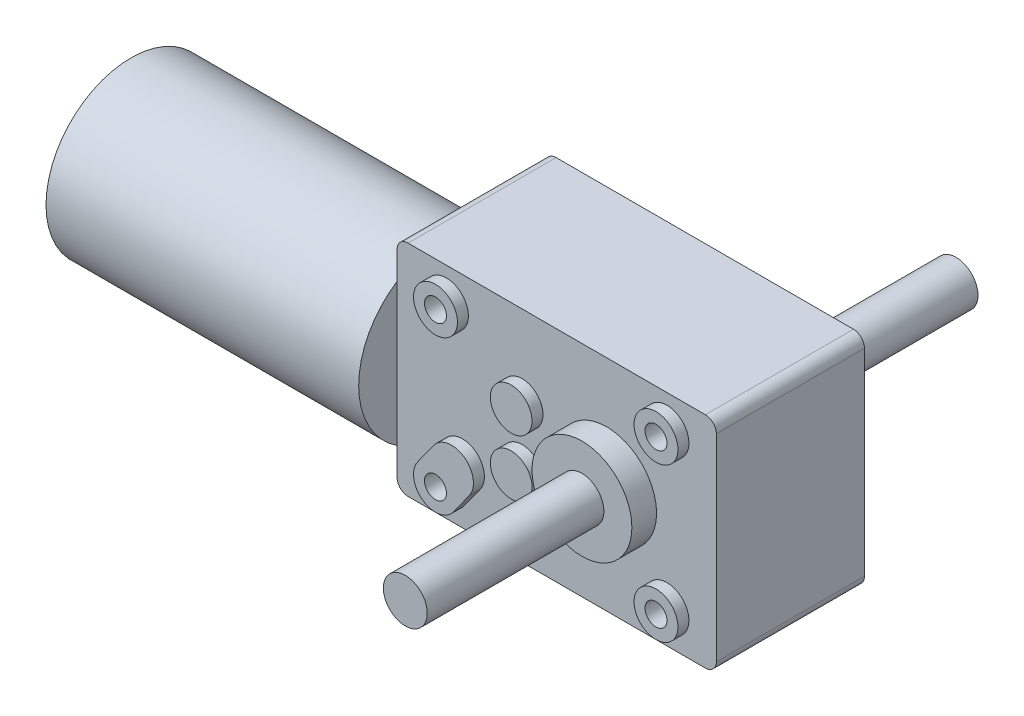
from build123d import *

# Parameters (mm, degrees)
BOSS_EXTRU_1_DEPTH      = 13.5
ESQUISSE2_R             = 4
ESQUISSE2_R_2           = 3.8
BOSS_EXTRU_2_DEPTH      = 2
ESQUISSE4_R             = 9.1
BOSS_EXTRU_3_DEPTH      = 4.5
ESQUISSE5_R             = 4
BOSS_EXTRU_4_DEPTH      = 32.2
ESQUISSE6_R             = 2
ENL_V_MAT_EXTRU_1_DEPTH = 5
ESQUISSE7_R             = 15.5
BOSS_EXTRU_5_DEPTH      = 57
ESQUISSE8_R             = 6
BOSS_EXTRU_6_DEPTH      = 2
ESQUISSE9_R             = 1.5
BOSS_EXTRU_7_DEPTH      = 2


with BuildPart() as part:
    # Esquisse1 → Boss.-Extru.1 (new body)
    with BuildSketch(Plane.XY):
        with BuildLine():
            Line((2, 0), (56.2, 0))
            ThreePointArc((56.2, 0), (57.614213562, 0.585786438), (58.2, 2))
            Line((58.2, 2), (58.2, 38))
            ThreePointArc((58.2, 38), (57.614213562, 39.414213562), (56.2, 40))
            Line((56.2, 40), (2, 40))
            ThreePointArc((2, 40), (0.585786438, 39.414213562), (0, 38))
            Line((0, 38), (0, 2))
            ThreePointArc((0, 2), (0.585786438, 0.585786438), (2, 0))
        make_face()
    boss_extru_1 = extrude(amount=BOSS_EXTRU_1_DEPTH)

    # Esquisse2 → Boss.-Extru.2 (add)
    with BuildSketch(Plane.XY.offset(13.5)):
        with Locations(Location((9, 34, 0), (0, 0, 180))):
            Circle(ESQUISSE2_R)
        with Locations(Location((49.2, 34, 0), (0, 0, 180))):
            Circle(ESQUISSE2_R)
        with Locations(Location((49.2, 6, 0), (0, 0, 180))):
            Circle(ESQUISSE2_R)
        with Locations(Location((22.8, 25.2, 0), (0, 0, 180))):
            Circle(ESQUISSE2_R_2)
        with Locations(Location((22.8, 14.8, 0), (0, 0, 180))):
            Circle(ESQUISSE2_R_2)
        with BuildLine():
            Line((5.751938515, 8.334544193), (8.670118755, 12.394621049))
            ThreePointArc((8.670118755, 12.394621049), (14.252724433, 13.308138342), (15.166241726, 7.725532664))
            Line((15.166241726, 7.725532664), (12.248061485, 3.665455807))
            ThreePointArc((12.248061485, 3.665455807), (6.665455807, 2.751938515), (5.751938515, 8.334544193))
        make_face()
    boss_extru_2 = extrude(amount=BOSS_EXTRU_2_DEPTH)

    # Esquisse4 → Boss.-Extru.3 (add)
    with BuildSketch(Plane.XY.offset(13.5)):
        with Locations(Location((38.2, 20, 0), (0, 0, 180))):
            Circle(ESQUISSE4_R)
    boss_extru_3 = extrude(amount=BOSS_EXTRU_3_DEPTH)

    # Esquisse5 → Boss.-Extru.4 (add)
    with BuildSketch(Plane.XY.offset(18)):
        with Locations((38.2, 20)):
            Circle(ESQUISSE5_R)
    boss_extru_4 = extrude(amount=BOSS_EXTRU_4_DEPTH)

    # Esquisse6 → Enl_v. mat.-Extru.1 (cut)
    with BuildSketch(Plane.XY.offset(15.5)):
        with Locations((9, 34)):
            Circle(ESQUISSE6_R)
        with Locations((49.2, 34)):
            Circle(ESQUISSE6_R)
        with Locations((49.2, 6)):
            Circle(ESQUISSE6_R)
        with Locations((9, 6)):
            Circle(ESQUISSE6_R)
    enl_v_mat_extru_1 = extrude(amount=-ENL_V_MAT_EXTRU_1_DEPTH, mode=Mode.SUBTRACT)

    # Sym_trie1: Boss.-Extru.1, Boss.-Extru.2, Boss.-Extru.3, Boss.-Extru.4, Enl_v. mat.-Extru.1 across plane
    add(boss_extru_1.mirror(Plane(origin=(2, 2, 0), x_dir=(1, 0, 0), z_dir=(0, 0, -1))))
    add(boss_extru_2.mirror(Plane(origin=(2, 2, 0), x_dir=(1, 0, 0), z_dir=(0, 0, -1))))
    add(boss_extru_3.mirror(Plane(origin=(2, 2, 0), x_dir=(1, 0, 0), z_dir=(0, 0, -1))))
    add(boss_extru_4.mirror(Plane(origin=(2, 2, 0), x_dir=(1, 0, 0), z_dir=(0, 0, -1))))
    add(enl_v_mat_extru_1.mirror(Plane(origin=(2, 2, 0), x_dir=(1, 0, 0), z_dir=(0, 0, -1))), mode=Mode.SUBTRACT)

    # Esquisse7 → Boss.-Extru.5 (add)
    with BuildSketch(Plane.ZY):
        with Locations(Location((5, 20, 0), (0, 0, 303.256431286))):
            Circle(ESQUISSE7_R)
    extrude(amount=BOSS_EXTRU_5_DEPTH)

    # Esquisse8 → Boss.-Extru.6 (add)
    with BuildSketch(Plane.ZY.offset(57)):
        with Locations((5, 20)):
            Circle(ESQUISSE8_R)
    extrude(amount=BOSS_EXTRU_6_DEPTH)

    # Esquisse9 → Boss.-Extru.7 (add)
    with BuildSketch(Plane.ZY.offset(59)):
        with Locations((5, 20)):
            Circle(ESQUISSE9_R)
    extrude(amount=BOSS_EXTRU_7_DEPTH)


solid = part.part
